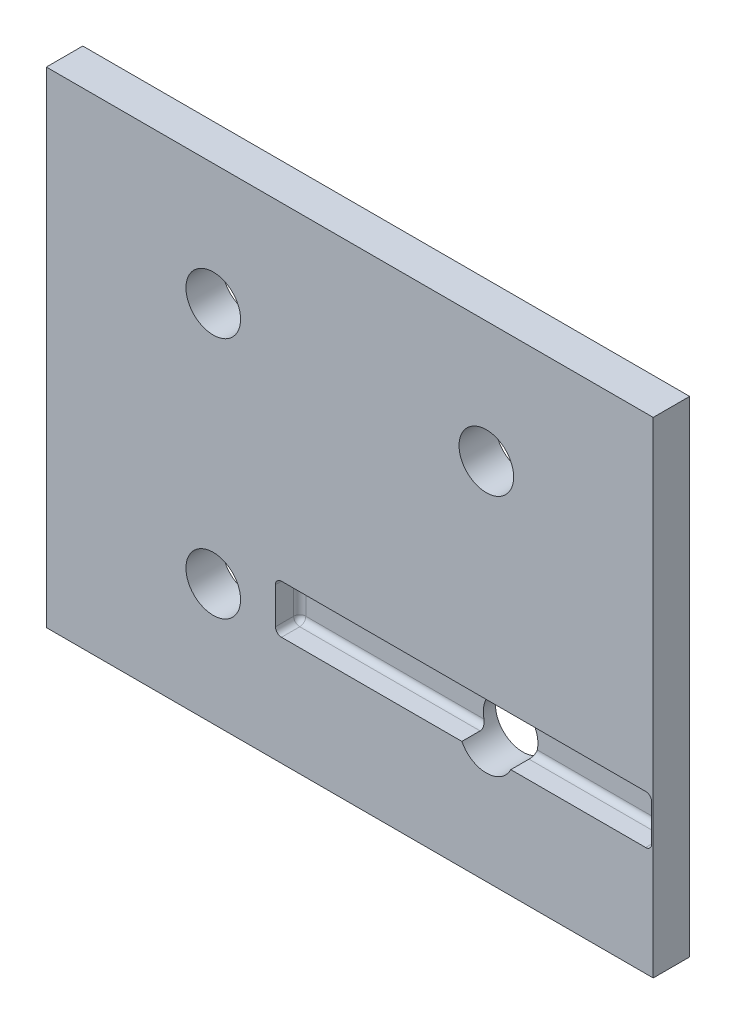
ISO-10303-21;
HEADER;
FILE_DESCRIPTION(('STEP AP214'),'2;1');
FILE_NAME('part.step','',(''),(''),'','','');
FILE_SCHEMA(('AUTOMOTIVE_DESIGN { 1 0 10303 214 1 1 1 1 }'));
ENDSEC;
DATA;
#1=APPLICATION_CONTEXT('core data for automotive mechanical design processes');
#2=APPLICATION_PROTOCOL_DEFINITION('international standard','automotive_design',2000,#1);
#3=PRODUCT_CONTEXT('',#1,'mechanical');
#4=PRODUCT('Part','Part','',(#3));
#5=PRODUCT_RELATED_PRODUCT_CATEGORY('part','',(#4));
#6=PRODUCT_DEFINITION_FORMATION('','',#4);
#7=PRODUCT_DEFINITION_CONTEXT('part definition',#1,'design');
#8=PRODUCT_DEFINITION('design','',#6,#7);
#9=PRODUCT_DEFINITION_SHAPE('','',#8);
#10=(LENGTH_UNIT() NAMED_UNIT(*) SI_UNIT(.MILLI.,.METRE.));
#11=(NAMED_UNIT(*) PLANE_ANGLE_UNIT() SI_UNIT($,.RADIAN.));
#12=(NAMED_UNIT(*) SI_UNIT($,.STERADIAN.) SOLID_ANGLE_UNIT());
#13=UNCERTAINTY_MEASURE_WITH_UNIT(LENGTH_MEASURE(1.E-05),#10,'distance_accuracy_value','');
#14=(GEOMETRIC_REPRESENTATION_CONTEXT(3) GLOBAL_UNCERTAINTY_ASSIGNED_CONTEXT((#13)) GLOBAL_UNIT_ASSIGNED_CONTEXT((#10,
#11,#12)) REPRESENTATION_CONTEXT('',''));
#15=CARTESIAN_POINT('',(0.,0.,0.));
#16=DIRECTION('',(0.,0.,1.));
#17=DIRECTION('',(1.,0.,0.));
#18=AXIS2_PLACEMENT_3D('',#15,#16,#17);
#19=CARTESIAN_POINT('',(-22.5,-42.,6.));
#20=DIRECTION('',(0.,0.707106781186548,-0.707106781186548));
#21=DIRECTION('',(0.577350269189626,0.577350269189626,0.577350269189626));
#22=AXIS2_PLACEMENT_3D('',#19,#20,#21);
#23=SPHERICAL_SURFACE('',#22,2.);
#24=CARTESIAN_POINT('',(-22.5,-42.,6.));
#25=DIRECTION('',(0.,0.,1.));
#26=DIRECTION('',(0.,1.,0.));
#27=AXIS2_PLACEMENT_3D('',#24,#25,#26);
#28=CIRCLE('',#27,2.);
#29=CARTESIAN_POINT('',(-24.5,-42.,6.));
#30=VERTEX_POINT('',#29);
#31=CARTESIAN_POINT('',(-22.5,-44.,6.));
#32=VERTEX_POINT('',#31);
#33=EDGE_CURVE('E446',#30,#32,#28,.T.);
#34=ORIENTED_EDGE('',*,*,#33,.T.);
#35=CARTESIAN_POINT('',(-22.5,-42.,6.));
#36=DIRECTION('',(-1.,0.,0.));
#37=DIRECTION('',(0.,1.,0.));
#38=AXIS2_PLACEMENT_3D('',#35,#36,#37);
#39=CIRCLE('',#38,2.);
#40=CARTESIAN_POINT('',(-22.5,-42.,4.));
#41=VERTEX_POINT('',#40);
#42=EDGE_CURVE('E445',#41,#32,#39,.T.);
#43=ORIENTED_EDGE('',*,*,#42,.F.);
#44=CARTESIAN_POINT('',(-22.5,-42.,6.));
#45=DIRECTION('',(0.,-1.,0.));
#46=DIRECTION('',(0.,0.,1.));
#47=AXIS2_PLACEMENT_3D('',#44,#45,#46);
#48=CIRCLE('',#47,2.);
#49=EDGE_CURVE('E10',#30,#41,#48,.T.);
#50=ORIENTED_EDGE('',*,*,#49,.F.);
#51=EDGE_LOOP('',(#34,#43,#50));
#52=FACE_BOUND('',#51,.T.);
#53=ADVANCED_FACE('F16',(#52),#23,.F.);
#54=CARTESIAN_POINT('',(-22.5,-42.,6.));
#55=DIRECTION('',(0.,1.,0.));
#56=DIRECTION('',(0.,0.,1.));
#57=AXIS2_PLACEMENT_3D('',#54,#55,#56);
#58=CYLINDRICAL_SURFACE('',#57,2.);
#59=DIRECTION('',(0.,1.,0.));
#60=VECTOR('',#59,1.);
#61=CARTESIAN_POINT('',(-24.5,-42.,6.));
#62=LINE('',#61,#60);
#63=CARTESIAN_POINT('',(-24.5,-30.,6.));
#64=VERTEX_POINT('',#63);
#65=EDGE_CURVE('E354',#30,#64,#62,.T.);
#66=ORIENTED_EDGE('',*,*,#65,.F.);
#67=ORIENTED_EDGE('',*,*,#49,.T.);
#68=DIRECTION('',(0.,1.,0.));
#69=VECTOR('',#68,1.);
#70=CARTESIAN_POINT('',(-22.5,-42.,4.));
#71=LINE('',#70,#69);
#72=CARTESIAN_POINT('',(-22.5,-30.,4.));
#73=VERTEX_POINT('',#72);
#74=EDGE_CURVE('E428',#41,#73,#71,.T.);
#75=ORIENTED_EDGE('',*,*,#74,.T.);
#76=CARTESIAN_POINT('',(-22.5,-30.,6.));
#77=DIRECTION('',(0.,-1.,0.));
#78=DIRECTION('',(0.,0.,1.));
#79=AXIS2_PLACEMENT_3D('',#76,#77,#78);
#80=CIRCLE('',#79,2.);
#81=EDGE_CURVE('E24',#64,#73,#80,.T.);
#82=ORIENTED_EDGE('',*,*,#81,.F.);
#83=EDGE_LOOP('',(#66,#67,#75,#82));
#84=FACE_BOUND('',#83,.T.);
#85=ADVANCED_FACE('F717',(#84),#58,.F.);
#86=CARTESIAN_POINT('',(-22.5,-30.,6.));
#87=DIRECTION('',(0.,0.707106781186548,0.707106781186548));
#88=DIRECTION('',(0.577350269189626,-0.577350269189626,0.577350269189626));
#89=AXIS2_PLACEMENT_3D('',#86,#87,#88);
#90=SPHERICAL_SURFACE('',#89,2.);
#91=CARTESIAN_POINT('',(-22.5,-30.,6.));
#92=DIRECTION('',(1.,0.,0.));
#93=DIRECTION('',(0.,-1.,0.));
#94=AXIS2_PLACEMENT_3D('',#91,#92,#93);
#95=CIRCLE('',#94,2.);
#96=CARTESIAN_POINT('',(-22.5,-28.,6.));
#97=VERTEX_POINT('',#96);
#98=EDGE_CURVE('E456',#73,#97,#95,.T.);
#99=ORIENTED_EDGE('',*,*,#98,.T.);
#100=CARTESIAN_POINT('',(-22.5,-30.,6.));
#101=DIRECTION('',(0.,0.,-1.));
#102=DIRECTION('',(0.,-1.,0.));
#103=AXIS2_PLACEMENT_3D('',#100,#101,#102);
#104=CIRCLE('',#103,2.);
#105=EDGE_CURVE('E288',#64,#97,#104,.T.);
#106=ORIENTED_EDGE('',*,*,#105,.F.);
#107=ORIENTED_EDGE('',*,*,#81,.T.);
#108=EDGE_LOOP('',(#99,#106,#107));
#109=FACE_BOUND('',#108,.T.);
#110=ADVANCED_FACE('F610',(#109),#90,.F.);
#111=CARTESIAN_POINT('',(97.5,-30.,6.));
#112=DIRECTION('',(-1.,0.,0.));
#113=DIRECTION('',(0.,-1.,0.));
#114=AXIS2_PLACEMENT_3D('',#111,#112,#113);
#115=CYLINDRICAL_SURFACE('',#114,2.);
#116=DIRECTION('',(-1.,0.,0.));
#117=VECTOR('',#116,1.);
#118=CARTESIAN_POINT('',(97.5,-30.,4.));
#119=LINE('',#118,#117);
#120=CARTESIAN_POINT('',(97.5,-30.,4.));
#121=VERTEX_POINT('',#120);
#122=EDGE_CURVE('E432',#121,#73,#119,.T.);
#123=ORIENTED_EDGE('',*,*,#122,.F.);
#124=CARTESIAN_POINT('',(97.5,-30.,6.));
#125=DIRECTION('',(1.,0.,0.));
#126=DIRECTION('',(0.,-1.,0.));
#127=AXIS2_PLACEMENT_3D('',#124,#125,#126);
#128=CIRCLE('',#127,2.);
#129=CARTESIAN_POINT('',(97.5,-28.,6.));
#130=VERTEX_POINT('',#129);
#131=EDGE_CURVE('E453',#121,#130,#128,.T.);
#132=ORIENTED_EDGE('',*,*,#131,.T.);
#133=DIRECTION('',(-1.,0.,0.));
#134=VECTOR('',#133,1.);
#135=CARTESIAN_POINT('',(97.5,-28.,6.));
#136=LINE('',#135,#134);
#137=EDGE_CURVE('E289',#130,#97,#136,.T.);
#138=ORIENTED_EDGE('',*,*,#137,.T.);
#139=ORIENTED_EDGE('',*,*,#98,.F.);
#140=EDGE_LOOP('',(#123,#132,#138,#139));
#141=FACE_BOUND('',#140,.T.);
#142=ADVANCED_FACE('F488',(#141),#115,.F.);
#143=CARTESIAN_POINT('',(97.5,-30.,6.));
#144=DIRECTION('',(0.,-0.707106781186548,-0.707106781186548));
#145=DIRECTION('',(-0.577350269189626,-0.577350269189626,0.577350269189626));
#146=AXIS2_PLACEMENT_3D('',#143,#144,#145);
#147=SPHERICAL_SURFACE('',#146,2.);
#148=CARTESIAN_POINT('',(97.5,-30.,6.));
#149=DIRECTION('',(0.,0.,1.));
#150=DIRECTION('',(0.,-1.,0.));
#151=AXIS2_PLACEMENT_3D('',#148,#149,#150);
#152=CIRCLE('',#151,2.);
#153=CARTESIAN_POINT('',(99.5,-30.,6.));
#154=VERTEX_POINT('',#153);
#155=EDGE_CURVE('E274',#154,#130,#152,.T.);
#156=ORIENTED_EDGE('',*,*,#155,.T.);
#157=ORIENTED_EDGE('',*,*,#131,.F.);
#158=CARTESIAN_POINT('',(97.5,-30.,6.));
#159=DIRECTION('',(0.,1.,0.));
#160=DIRECTION('',(0.,0.,1.));
#161=AXIS2_PLACEMENT_3D('',#158,#159,#160);
#162=CIRCLE('',#161,2.);
#163=EDGE_CURVE('E444',#154,#121,#162,.T.);
#164=ORIENTED_EDGE('',*,*,#163,.F.);
#165=EDGE_LOOP('',(#156,#157,#164));
#166=FACE_BOUND('',#165,.T.);
#167=ADVANCED_FACE('F482',(#166),#147,.F.);
#168=CARTESIAN_POINT('',(97.5,-42.,6.));
#169=DIRECTION('',(0.,1.,0.));
#170=DIRECTION('',(0.,0.,1.));
#171=AXIS2_PLACEMENT_3D('',#168,#169,#170);
#172=CYLINDRICAL_SURFACE('',#171,2.);
#173=ORIENTED_EDGE('',*,*,#163,.T.);
#174=DIRECTION('',(0.,1.,0.));
#175=VECTOR('',#174,1.);
#176=CARTESIAN_POINT('',(97.5,-42.,4.));
#177=LINE('',#176,#175);
#178=CARTESIAN_POINT('',(97.5,-42.,4.));
#179=VERTEX_POINT('',#178);
#180=EDGE_CURVE('E338',#179,#121,#177,.T.);
#181=ORIENTED_EDGE('',*,*,#180,.F.);
#182=CARTESIAN_POINT('',(97.5,-42.,6.));
#183=DIRECTION('',(0.,1.,0.));
#184=DIRECTION('',(0.,0.,1.));
#185=AXIS2_PLACEMENT_3D('',#182,#183,#184);
#186=CIRCLE('',#185,2.);
#187=CARTESIAN_POINT('',(99.5,-42.,6.));
#188=VERTEX_POINT('',#187);
#189=EDGE_CURVE('E441',#188,#179,#186,.T.);
#190=ORIENTED_EDGE('',*,*,#189,.F.);
#191=DIRECTION('',(0.,1.,0.));
#192=VECTOR('',#191,1.);
#193=CARTESIAN_POINT('',(99.5,-42.,6.));
#194=LINE('',#193,#192);
#195=EDGE_CURVE('E419',#188,#154,#194,.T.);
#196=ORIENTED_EDGE('',*,*,#195,.T.);
#197=EDGE_LOOP('',(#173,#181,#190,#196));
#198=FACE_BOUND('',#197,.T.);
#199=ADVANCED_FACE('F487',(#198),#172,.F.);
#200=CARTESIAN_POINT('',(97.5,-42.,6.));
#201=DIRECTION('',(0.,-0.707106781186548,0.707106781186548));
#202=DIRECTION('',(-0.577350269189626,0.577350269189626,0.577350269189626));
#203=AXIS2_PLACEMENT_3D('',#200,#201,#202);
#204=SPHERICAL_SURFACE('',#203,2.);
#205=CARTESIAN_POINT('',(97.5,-42.,6.));
#206=DIRECTION('',(-1.,0.,0.));
#207=DIRECTION('',(0.,1.,0.));
#208=AXIS2_PLACEMENT_3D('',#205,#206,#207);
#209=CIRCLE('',#208,2.);
#210=CARTESIAN_POINT('',(97.5,-44.,6.));
#211=VERTEX_POINT('',#210);
#212=EDGE_CURVE('E466',#179,#211,#209,.T.);
#213=ORIENTED_EDGE('',*,*,#212,.T.);
#214=CARTESIAN_POINT('',(97.5,-42.,6.));
#215=DIRECTION('',(0.,0.,-1.));
#216=DIRECTION('',(0.,1.,0.));
#217=AXIS2_PLACEMENT_3D('',#214,#215,#216);
#218=CIRCLE('',#217,2.);
#219=EDGE_CURVE('E253',#188,#211,#218,.T.);
#220=ORIENTED_EDGE('',*,*,#219,.F.);
#221=ORIENTED_EDGE('',*,*,#189,.T.);
#222=EDGE_LOOP('',(#213,#220,#221));
#223=FACE_BOUND('',#222,.T.);
#224=ADVANCED_FACE('F694',(#223),#204,.F.);
#225=CARTESIAN_POINT('',(97.5,-42.,6.));
#226=DIRECTION('',(-1.,0.,0.));
#227=DIRECTION('',(0.,1.,0.));
#228=AXIS2_PLACEMENT_3D('',#225,#226,#227);
#229=CYLINDRICAL_SURFACE('',#228,2.);
#230=ORIENTED_EDGE('',*,*,#42,.T.);
#231=DIRECTION('',(-1.,0.,0.));
#232=VECTOR('',#231,1.);
#233=CARTESIAN_POINT('',(97.5,-44.,6.));
#234=LINE('',#233,#232);
#235=CARTESIAN_POINT('',(36.937742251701,-44.,6.));
#236=VERTEX_POINT('',#235);
#237=EDGE_CURVE('E339',#236,#32,#234,.T.);
#238=ORIENTED_EDGE('',*,*,#237,.F.);
#239=CARTESIAN_POINT('',(36.225035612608,-42.,4.));
#240=CARTESIAN_POINT('',(36.280961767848,-42.24537501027,4.));
#241=CARTESIAN_POINT('',(36.34357534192,-42.48314370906,4.035121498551));
#242=CARTESIAN_POINT('',(36.410977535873,-42.70811551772,4.101447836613));
#243=CARTESIAN_POINT('',(36.480506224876,-42.91622868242,4.19465857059));
#244=CARTESIAN_POINT('',(36.549100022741,-43.10441301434,4.309987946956));
#245=CARTESIAN_POINT('',(36.613887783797,-43.27065664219,4.442229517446));
#246=CARTESIAN_POINT('',(36.741289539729,-43.58138901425,4.752961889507));
#247=CARTESIAN_POINT('',(36.803076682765,-43.7209321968,4.938615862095));
#248=CARTESIAN_POINT('',(36.855403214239,-43.83249840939,5.137862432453));
#249=CARTESIAN_POINT('',(36.896136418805,-43.91614081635,5.346790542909));
#250=CARTESIAN_POINT('',(36.923835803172,-43.97197063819,5.562091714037));
#251=CARTESIAN_POINT('',(36.937742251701,-44.,5.780795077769));
#252=CARTESIAN_POINT('',(36.937742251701,-44.,6.));
#253=(BOUNDED_CURVE() B_SPLINE_CURVE(7,(#239,#240,#241,#242,#243,#244,#245,#246,#247,#248,#249,
#250,#251,#252),.UNSPECIFIED.,.F.,.F.) B_SPLINE_CURVE_WITH_KNOTS((8,6,8),(0.,0.46199537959,1.),
.UNSPECIFIED.) CURVE() GEOMETRIC_REPRESENTATION_ITEM() RATIONAL_B_SPLINE_CURVE((1.,1.,1.,1.,1.,
1.,1.,1.,1.,1.,1.,1.,1.,1.)) REPRESENTATION_ITEM(''));
#254=CARTESIAN_POINT('',(36.225035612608,-42.,4.));
#255=VERTEX_POINT('',#254);
#256=EDGE_CURVE('E306',#255,#236,#253,.T.);
#257=ORIENTED_EDGE('',*,*,#256,.F.);
#258=DIRECTION('',(-1.,0.,0.));
#259=VECTOR('',#258,1.);
#260=CARTESIAN_POINT('',(97.5,-42.,4.));
#261=LINE('',#260,#259);
#262=EDGE_CURVE('E431',#255,#41,#261,.T.);
#263=ORIENTED_EDGE('',*,*,#262,.T.);
#264=EDGE_LOOP('',(#230,#238,#257,#263));
#265=FACE_BOUND('',#264,.T.);
#266=ADVANCED_FACE('F685',(#265),#229,.F.);
#267=CARTESIAN_POINT('',(97.5,-42.,6.));
#268=DIRECTION('',(-1.,0.,0.));
#269=DIRECTION('',(0.,1.,0.));
#270=AXIS2_PLACEMENT_3D('',#267,#268,#269);
#271=CYLINDRICAL_SURFACE('',#270,2.);
#272=CARTESIAN_POINT('',(53.774964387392,-42.,4.));
#273=CARTESIAN_POINT('',(53.719038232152,-42.24537501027,4.));
#274=CARTESIAN_POINT('',(53.65642465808,-42.48314370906,4.035121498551));
#275=CARTESIAN_POINT('',(53.589022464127,-42.70811551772,4.101447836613));
#276=CARTESIAN_POINT('',(53.519493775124,-42.91622868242,4.19465857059));
#277=CARTESIAN_POINT('',(53.450899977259,-43.10441301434,4.309987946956));
#278=CARTESIAN_POINT('',(53.386112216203,-43.27065664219,4.442229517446));
#279=CARTESIAN_POINT('',(53.258710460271,-43.58138901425,4.752961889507));
#280=CARTESIAN_POINT('',(53.196923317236,-43.7209321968,4.938615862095));
#281=CARTESIAN_POINT('',(53.144596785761,-43.83249840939,5.137862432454));
#282=CARTESIAN_POINT('',(53.103863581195,-43.91614081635,5.346790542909));
#283=CARTESIAN_POINT('',(53.076164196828,-43.97197063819,5.562091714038));
#284=CARTESIAN_POINT('',(53.062257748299,-44.,5.780795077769));
#285=CARTESIAN_POINT('',(53.062257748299,-44.,6.));
#286=(BOUNDED_CURVE() B_SPLINE_CURVE(7,(#272,#273,#274,#275,#276,#277,#278,#279,#280,#281,#282,
#283,#284,#285),.UNSPECIFIED.,.F.,.F.) B_SPLINE_CURVE_WITH_KNOTS((8,6,8),(0.,0.46199537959,1.),
.UNSPECIFIED.) CURVE() GEOMETRIC_REPRESENTATION_ITEM() RATIONAL_B_SPLINE_CURVE((1.,1.,1.,1.,1.,
1.,1.,1.,1.,1.,1.,1.,1.,1.)) REPRESENTATION_ITEM(''));
#287=CARTESIAN_POINT('',(53.774964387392,-42.,4.));
#288=VERTEX_POINT('',#287);
#289=CARTESIAN_POINT('',(53.062257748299,-44.,6.));
#290=VERTEX_POINT('',#289);
#291=EDGE_CURVE('E370',#288,#290,#286,.T.);
#292=ORIENTED_EDGE('',*,*,#291,.T.);
#293=DIRECTION('',(-1.,0.,0.));
#294=VECTOR('',#293,1.);
#295=CARTESIAN_POINT('',(97.5,-44.,6.));
#296=LINE('',#295,#294);
#297=EDGE_CURVE('E262',#211,#290,#296,.T.);
#298=ORIENTED_EDGE('',*,*,#297,.F.);
#299=ORIENTED_EDGE('',*,*,#212,.F.);
#300=DIRECTION('',(-1.,0.,0.));
#301=VECTOR('',#300,1.);
#302=CARTESIAN_POINT('',(97.5,-42.,4.));
#303=LINE('',#302,#301);
#304=EDGE_CURVE('E335',#179,#288,#303,.T.);
#305=ORIENTED_EDGE('',*,*,#304,.T.);
#306=EDGE_LOOP('',(#292,#298,#299,#305));
#307=FACE_BOUND('',#306,.T.);
#308=ADVANCED_FACE('F676',(#307),#271,.F.);
#309=CARTESIAN_POINT('',(97.5,-42.,4.));
#310=DIRECTION('',(0.,0.,1.));
#311=DIRECTION('',(1.,0.,0.));
#312=AXIS2_PLACEMENT_3D('',#309,#310,#311);
#313=PLANE('',#312);
#314=ORIENTED_EDGE('',*,*,#304,.F.);
#315=ORIENTED_EDGE('',*,*,#180,.T.);
#316=ORIENTED_EDGE('',*,*,#122,.T.);
#317=ORIENTED_EDGE('',*,*,#74,.F.);
#318=ORIENTED_EDGE('',*,*,#262,.F.);
#319=CARTESIAN_POINT('',(45.,-40.,4.));
#320=DIRECTION('',(0.,0.,-1.));
#321=DIRECTION('',(1.,0.,0.));
#322=AXIS2_PLACEMENT_3D('',#319,#320,#321);
#323=CIRCLE('',#322,9.);
#324=CARTESIAN_POINT('',(54.,-40.,4.));
#325=VERTEX_POINT('',#324);
#326=EDGE_CURVE('E313',#255,#325,#323,.T.);
#327=ORIENTED_EDGE('',*,*,#326,.T.);
#328=CARTESIAN_POINT('',(45.,-40.,4.));
#329=DIRECTION('',(0.,0.,-1.));
#330=DIRECTION('',(1.,0.,0.));
#331=AXIS2_PLACEMENT_3D('',#328,#329,#330);
#332=CIRCLE('',#331,9.);
#333=EDGE_CURVE('E376',#325,#288,#332,.T.);
#334=ORIENTED_EDGE('',*,*,#333,.T.);
#335=EDGE_LOOP('',(#314,#315,#316,#317,#318,#327,#334));
#336=FACE_BOUND('',#335,.T.);
#337=ADVANCED_FACE('F667',(#336),#313,.T.);
#338=CARTESIAN_POINT('',(37.5,-44.,66.));
#339=DIRECTION('',(0.,1.,0.));
#340=DIRECTION('',(1.,0.,0.));
#341=AXIS2_PLACEMENT_3D('',#338,#339,#340);
#342=PLANE('',#341);
#343=ORIENTED_EDGE('',*,*,#237,.T.);
#344=DIRECTION('',(0.,0.,1.));
#345=VECTOR('',#344,1.);
#346=CARTESIAN_POINT('',(-22.5,-44.,6.));
#347=LINE('',#346,#345);
#348=CARTESIAN_POINT('',(-22.5,-44.,12.));
#349=VERTEX_POINT('',#348);
#350=EDGE_CURVE('E240',#32,#349,#347,.T.);
#351=ORIENTED_EDGE('',*,*,#350,.T.);
#352=DIRECTION('',(-1.,0.,0.));
#353=VECTOR('',#352,1.);
#354=CARTESIAN_POINT('',(18.75,-44.,12.));
#355=LINE('',#354,#353);
#356=CARTESIAN_POINT('',(36.937742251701,-44.,12.));
#357=VERTEX_POINT('',#356);
#358=EDGE_CURVE('E343',#357,#349,#355,.T.);
#359=ORIENTED_EDGE('',*,*,#358,.F.);
#360=DIRECTION('',(0.,0.,-1.));
#361=VECTOR('',#360,1.);
#362=CARTESIAN_POINT('',(36.937742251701,-44.,0.));
#363=LINE('',#362,#361);
#364=EDGE_CURVE('E312',#357,#236,#363,.T.);
#365=ORIENTED_EDGE('',*,*,#364,.T.);
#366=EDGE_LOOP('',(#343,#351,#359,#365));
#367=FACE_BOUND('',#366,.T.);
#368=ADVANCED_FACE('F658',(#367),#342,.T.);
#369=CARTESIAN_POINT('',(-22.5,-42.,6.));
#370=DIRECTION('',(0.,0.,1.));
#371=DIRECTION('',(0.,1.,0.));
#372=AXIS2_PLACEMENT_3D('',#369,#370,#371);
#373=CYLINDRICAL_SURFACE('',#372,2.);
#374=CARTESIAN_POINT('',(-22.5,-42.,12.));
#375=DIRECTION('',(0.,0.,1.));
#376=DIRECTION('',(0.,1.,0.));
#377=AXIS2_PLACEMENT_3D('',#374,#375,#376);
#378=CIRCLE('',#377,2.);
#379=CARTESIAN_POINT('',(-24.5,-42.,12.));
#380=VERTEX_POINT('',#379);
#381=EDGE_CURVE('E347',#380,#349,#378,.T.);
#382=ORIENTED_EDGE('',*,*,#381,.T.);
#383=ORIENTED_EDGE('',*,*,#350,.F.);
#384=ORIENTED_EDGE('',*,*,#33,.F.);
#385=DIRECTION('',(0.,0.,1.));
#386=VECTOR('',#385,1.);
#387=CARTESIAN_POINT('',(-24.5,-42.,6.));
#388=LINE('',#387,#386);
#389=EDGE_CURVE('E358',#30,#380,#388,.T.);
#390=ORIENTED_EDGE('',*,*,#389,.T.);
#391=EDGE_LOOP('',(#382,#383,#384,#390));
#392=FACE_BOUND('',#391,.T.);
#393=ADVANCED_FACE('F649',(#392),#373,.F.);
#394=CARTESIAN_POINT('',(-24.5,-42.,6.));
#395=DIRECTION('',(1.,0.,0.));
#396=DIRECTION('',(0.,1.,0.));
#397=AXIS2_PLACEMENT_3D('',#394,#395,#396);
#398=PLANE('',#397);
#399=ORIENTED_EDGE('',*,*,#389,.F.);
#400=ORIENTED_EDGE('',*,*,#65,.T.);
#401=DIRECTION('',(0.,0.,1.));
#402=VECTOR('',#401,1.);
#403=CARTESIAN_POINT('',(-24.5,-30.,6.));
#404=LINE('',#403,#402);
#405=CARTESIAN_POINT('',(-24.5,-30.,12.));
#406=VERTEX_POINT('',#405);
#407=EDGE_CURVE('E285',#64,#406,#404,.T.);
#408=ORIENTED_EDGE('',*,*,#407,.T.);
#409=DIRECTION('',(0.,1.,0.));
#410=VECTOR('',#409,1.);
#411=CARTESIAN_POINT('',(-24.5,-21.,12.));
#412=LINE('',#411,#410);
#413=EDGE_CURVE('E330',#380,#406,#412,.T.);
#414=ORIENTED_EDGE('',*,*,#413,.F.);
#415=EDGE_LOOP('',(#399,#400,#408,#414));
#416=FACE_BOUND('',#415,.T.);
#417=ADVANCED_FACE('F594',(#416),#398,.T.);
#418=CARTESIAN_POINT('',(-22.5,-30.,6.));
#419=DIRECTION('',(0.,0.,1.));
#420=DIRECTION('',(0.,-1.,0.));
#421=AXIS2_PLACEMENT_3D('',#418,#419,#420);
#422=CYLINDRICAL_SURFACE('',#421,2.);
#423=ORIENTED_EDGE('',*,*,#407,.F.);
#424=ORIENTED_EDGE('',*,*,#105,.T.);
#425=DIRECTION('',(0.,0.,1.));
#426=VECTOR('',#425,1.);
#427=CARTESIAN_POINT('',(-22.5,-28.,6.));
#428=LINE('',#427,#426);
#429=CARTESIAN_POINT('',(-22.5,-28.,12.));
#430=VERTEX_POINT('',#429);
#431=EDGE_CURVE('E278',#97,#430,#428,.T.);
#432=ORIENTED_EDGE('',*,*,#431,.T.);
#433=CARTESIAN_POINT('',(-22.5,-30.,12.));
#434=DIRECTION('',(0.,0.,1.));
#435=DIRECTION('',(0.,-1.,0.));
#436=AXIS2_PLACEMENT_3D('',#433,#434,#435);
#437=CIRCLE('',#436,2.);
#438=EDGE_CURVE('E326',#430,#406,#437,.T.);
#439=ORIENTED_EDGE('',*,*,#438,.T.);
#440=EDGE_LOOP('',(#423,#424,#432,#439));
#441=FACE_BOUND('',#440,.T.);
#442=ADVANCED_FACE('F544',(#441),#422,.F.);
#443=CARTESIAN_POINT('',(37.5,-28.,66.));
#444=DIRECTION('',(0.,1.,0.));
#445=DIRECTION('',(1.,0.,0.));
#446=AXIS2_PLACEMENT_3D('',#443,#444,#445);
#447=PLANE('',#446);
#448=DIRECTION('',(0.,0.,-1.));
#449=VECTOR('',#448,1.);
#450=CARTESIAN_POINT('',(97.5,-28.,126.));
#451=LINE('',#450,#449);
#452=CARTESIAN_POINT('',(97.5,-28.,12.));
#453=VERTEX_POINT('',#452);
#454=EDGE_CURVE('E279',#453,#130,#451,.T.);
#455=ORIENTED_EDGE('',*,*,#454,.F.);
#456=DIRECTION('',(-1.,0.,0.));
#457=VECTOR('',#456,1.);
#458=CARTESIAN_POINT('',(18.75,-28.,12.));
#459=LINE('',#458,#457);
#460=EDGE_CURVE('E325',#453,#430,#459,.T.);
#461=ORIENTED_EDGE('',*,*,#460,.T.);
#462=ORIENTED_EDGE('',*,*,#431,.F.);
#463=ORIENTED_EDGE('',*,*,#137,.F.);
#464=EDGE_LOOP('',(#455,#461,#462,#463));
#465=FACE_BOUND('',#464,.T.);
#466=ADVANCED_FACE('F538',(#465),#447,.F.);
#467=CARTESIAN_POINT('',(97.5,-30.,126.));
#468=DIRECTION('',(0.,0.,-1.));
#469=DIRECTION('',(0.,-1.,0.));
#470=AXIS2_PLACEMENT_3D('',#467,#468,#469);
#471=CYLINDRICAL_SURFACE('',#470,2.);
#472=DIRECTION('',(0.,0.,-1.));
#473=VECTOR('',#472,1.);
#474=CARTESIAN_POINT('',(99.5,-30.,126.));
#475=LINE('',#474,#473);
#476=CARTESIAN_POINT('',(99.5,-30.,12.));
#477=VERTEX_POINT('',#476);
#478=EDGE_CURVE('E252',#477,#154,#475,.T.);
#479=ORIENTED_EDGE('',*,*,#478,.F.);
#480=CARTESIAN_POINT('',(97.5,-30.,12.));
#481=DIRECTION('',(0.,0.,-1.));
#482=DIRECTION('',(0.,-1.,0.));
#483=AXIS2_PLACEMENT_3D('',#480,#481,#482);
#484=CIRCLE('',#483,2.);
#485=EDGE_CURVE('E320',#453,#477,#484,.T.);
#486=ORIENTED_EDGE('',*,*,#485,.F.);
#487=ORIENTED_EDGE('',*,*,#454,.T.);
#488=ORIENTED_EDGE('',*,*,#155,.F.);
#489=EDGE_LOOP('',(#479,#486,#487,#488));
#490=FACE_BOUND('',#489,.T.);
#491=ADVANCED_FACE('F543',(#490),#471,.F.);
#492=CARTESIAN_POINT('',(99.5,-42.,126.));
#493=DIRECTION('',(-1.,0.,0.));
#494=DIRECTION('',(0.,0.,1.));
#495=AXIS2_PLACEMENT_3D('',#492,#493,#494);
#496=PLANE('',#495);
#497=DIRECTION('',(0.,0.,-1.));
#498=VECTOR('',#497,1.);
#499=CARTESIAN_POINT('',(99.5,-42.,126.));
#500=LINE('',#499,#498);
#501=CARTESIAN_POINT('',(99.5,-42.,12.));
#502=VERTEX_POINT('',#501);
#503=EDGE_CURVE('E248',#502,#188,#500,.T.);
#504=ORIENTED_EDGE('',*,*,#503,.F.);
#505=DIRECTION('',(0.,-1.,0.));
#506=VECTOR('',#505,1.);
#507=CARTESIAN_POINT('',(99.5,-21.,12.));
#508=LINE('',#507,#506);
#509=EDGE_CURVE('E324',#477,#502,#508,.T.);
#510=ORIENTED_EDGE('',*,*,#509,.F.);
#511=ORIENTED_EDGE('',*,*,#478,.T.);
#512=ORIENTED_EDGE('',*,*,#195,.F.);
#513=EDGE_LOOP('',(#504,#510,#511,#512));
#514=FACE_BOUND('',#513,.T.);
#515=ADVANCED_FACE('F578',(#514),#496,.T.);
#516=CARTESIAN_POINT('',(97.5,-42.,126.));
#517=DIRECTION('',(0.,0.,-1.));
#518=DIRECTION('',(0.,1.,0.));
#519=AXIS2_PLACEMENT_3D('',#516,#517,#518);
#520=CYLINDRICAL_SURFACE('',#519,2.);
#521=ORIENTED_EDGE('',*,*,#219,.T.);
#522=DIRECTION('',(0.,0.,-1.));
#523=VECTOR('',#522,1.);
#524=CARTESIAN_POINT('',(97.5,-44.,126.));
#525=LINE('',#524,#523);
#526=CARTESIAN_POINT('',(97.5,-44.,12.));
#527=VERTEX_POINT('',#526);
#528=EDGE_CURVE('E264',#527,#211,#525,.T.);
#529=ORIENTED_EDGE('',*,*,#528,.F.);
#530=CARTESIAN_POINT('',(97.5,-42.,12.));
#531=DIRECTION('',(0.,0.,-1.));
#532=DIRECTION('',(0.,1.,0.));
#533=AXIS2_PLACEMENT_3D('',#530,#531,#532);
#534=CIRCLE('',#533,2.);
#535=EDGE_CURVE('E365',#502,#527,#534,.T.);
#536=ORIENTED_EDGE('',*,*,#535,.F.);
#537=ORIENTED_EDGE('',*,*,#503,.T.);
#538=EDGE_LOOP('',(#521,#529,#536,#537));
#539=FACE_BOUND('',#538,.T.);
#540=ADVANCED_FACE('F619',(#539),#520,.F.);
#541=CARTESIAN_POINT('',(37.5,-44.,66.));
#542=DIRECTION('',(0.,1.,0.));
#543=DIRECTION('',(1.,0.,0.));
#544=AXIS2_PLACEMENT_3D('',#541,#542,#543);
#545=PLANE('',#544);
#546=ORIENTED_EDGE('',*,*,#297,.T.);
#547=DIRECTION('',(0.,0.,-1.));
#548=VECTOR('',#547,1.);
#549=CARTESIAN_POINT('',(53.062257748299,-44.,0.));
#550=LINE('',#549,#548);
#551=CARTESIAN_POINT('',(53.062257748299,-44.,12.));
#552=VERTEX_POINT('',#551);
#553=EDGE_CURVE('E377',#552,#290,#550,.T.);
#554=ORIENTED_EDGE('',*,*,#553,.F.);
#555=DIRECTION('',(-1.,0.,0.));
#556=VECTOR('',#555,1.);
#557=CARTESIAN_POINT('',(18.75,-44.,12.));
#558=LINE('',#557,#556);
#559=EDGE_CURVE('E369',#527,#552,#558,.T.);
#560=ORIENTED_EDGE('',*,*,#559,.F.);
#561=ORIENTED_EDGE('',*,*,#528,.T.);
#562=EDGE_LOOP('',(#546,#554,#560,#561));
#563=FACE_BOUND('',#562,.T.);
#564=ADVANCED_FACE('F531',(#563),#545,.T.);
#565=CARTESIAN_POINT('',(45.,40.,0.));
#566=DIRECTION('',(0.,0.,-1.));
#567=DIRECTION('',(1.,0.,0.));
#568=AXIS2_PLACEMENT_3D('',#565,#566,#567);
#569=CYLINDRICAL_SURFACE('',#568,9.);
#570=DIRECTION('',(0.,0.,1.));
#571=VECTOR('',#570,1.);
#572=CARTESIAN_POINT('',(54.,40.,0.));
#573=LINE('',#572,#571);
#574=CARTESIAN_POINT('',(54.,40.,0.));
#575=VERTEX_POINT('',#574);
#576=CARTESIAN_POINT('',(54.,40.,12.));
#577=VERTEX_POINT('',#576);
#578=EDGE_CURVE('E265',#575,#577,#573,.T.);
#579=ORIENTED_EDGE('',*,*,#578,.T.);
#580=CARTESIAN_POINT('',(45.,40.,12.));
#581=DIRECTION('',(0.,0.,1.));
#582=DIRECTION('',(1.,0.,0.));
#583=AXIS2_PLACEMENT_3D('',#580,#581,#582);
#584=CIRCLE('',#583,9.);
#585=EDGE_CURVE('E242',#577,#577,#584,.T.);
#586=ORIENTED_EDGE('',*,*,#585,.T.);
#587=ORIENTED_EDGE('',*,*,#578,.F.);
#588=CARTESIAN_POINT('',(45.,40.,0.));
#589=DIRECTION('',(0.,0.,1.));
#590=DIRECTION('',(1.,0.,0.));
#591=AXIS2_PLACEMENT_3D('',#588,#589,#590);
#592=CIRCLE('',#591,9.);
#593=EDGE_CURVE('E301',#575,#575,#592,.T.);
#594=ORIENTED_EDGE('',*,*,#593,.F.);
#595=EDGE_LOOP('',(#579,#586,#587,#594));
#596=FACE_BOUND('',#595,.T.);
#597=ADVANCED_FACE('F525',(#596),#569,.F.);
#598=CARTESIAN_POINT('',(45.,-40.,0.));
#599=DIRECTION('',(0.,0.,-1.));
#600=DIRECTION('',(1.,0.,0.));
#601=AXIS2_PLACEMENT_3D('',#598,#599,#600);
#602=CYLINDRICAL_SURFACE('',#601,9.);
#603=CARTESIAN_POINT('',(45.,-40.,0.));
#604=DIRECTION('',(0.,0.,1.));
#605=DIRECTION('',(1.,0.,0.));
#606=AXIS2_PLACEMENT_3D('',#603,#604,#605);
#607=CIRCLE('',#606,9.);
#608=CARTESIAN_POINT('',(54.,-40.,0.));
#609=VERTEX_POINT('',#608);
#610=EDGE_CURVE('E297',#609,#609,#607,.T.);
#611=ORIENTED_EDGE('',*,*,#610,.F.);
#612=DIRECTION('',(0.,0.,1.));
#613=VECTOR('',#612,1.);
#614=CARTESIAN_POINT('',(54.,-40.,0.));
#615=LINE('',#614,#613);
#616=EDGE_CURVE('E392',#609,#325,#615,.T.);
#617=ORIENTED_EDGE('',*,*,#616,.T.);
#618=ORIENTED_EDGE('',*,*,#326,.F.);
#619=ORIENTED_EDGE('',*,*,#256,.T.);
#620=ORIENTED_EDGE('',*,*,#364,.F.);
#621=CARTESIAN_POINT('',(45.,-40.,12.));
#622=DIRECTION('',(0.,0.,1.));
#623=DIRECTION('',(1.,0.,0.));
#624=AXIS2_PLACEMENT_3D('',#621,#622,#623);
#625=CIRCLE('',#624,9.);
#626=EDGE_CURVE('E334',#357,#552,#625,.T.);
#627=ORIENTED_EDGE('',*,*,#626,.T.);
#628=ORIENTED_EDGE('',*,*,#553,.T.);
#629=ORIENTED_EDGE('',*,*,#291,.F.);
#630=ORIENTED_EDGE('',*,*,#333,.F.);
#631=ORIENTED_EDGE('',*,*,#616,.F.);
#632=EDGE_LOOP('',(#611,#617,#618,#619,#620,#627,#628,#629,#630,#631));
#633=FACE_BOUND('',#632,.T.);
#634=ADVANCED_FACE('F530',(#633),#602,.F.);
#635=CARTESIAN_POINT('',(-45.,40.,0.));
#636=DIRECTION('',(0.,0.,-1.));
#637=DIRECTION('',(1.,0.,0.));
#638=AXIS2_PLACEMENT_3D('',#635,#636,#637);
#639=CYLINDRICAL_SURFACE('',#638,9.);
#640=DIRECTION('',(0.,0.,1.));
#641=VECTOR('',#640,1.);
#642=CARTESIAN_POINT('',(-36.,40.,0.));
#643=LINE('',#642,#641);
#644=CARTESIAN_POINT('',(-36.,40.,0.));
#645=VERTEX_POINT('',#644);
#646=CARTESIAN_POINT('',(-36.,40.,12.));
#647=VERTEX_POINT('',#646);
#648=EDGE_CURVE('E389',#645,#647,#643,.T.);
#649=ORIENTED_EDGE('',*,*,#648,.T.);
#650=CARTESIAN_POINT('',(-45.,40.,12.));
#651=DIRECTION('',(0.,0.,1.));
#652=DIRECTION('',(1.,0.,0.));
#653=AXIS2_PLACEMENT_3D('',#650,#651,#652);
#654=CIRCLE('',#653,9.);
#655=EDGE_CURVE('E246',#647,#647,#654,.T.);
#656=ORIENTED_EDGE('',*,*,#655,.T.);
#657=ORIENTED_EDGE('',*,*,#648,.F.);
#658=CARTESIAN_POINT('',(-45.,40.,0.));
#659=DIRECTION('',(0.,0.,1.));
#660=DIRECTION('',(1.,0.,0.));
#661=AXIS2_PLACEMENT_3D('',#658,#659,#660);
#662=CIRCLE('',#661,9.);
#663=EDGE_CURVE('E260',#645,#645,#662,.T.);
#664=ORIENTED_EDGE('',*,*,#663,.F.);
#665=EDGE_LOOP('',(#649,#656,#657,#664));
#666=FACE_BOUND('',#665,.T.);
#667=ADVANCED_FACE('F502',(#666),#639,.F.);
#668=CARTESIAN_POINT('',(-45.,-40.,0.));
#669=DIRECTION('',(0.,0.,-1.));
#670=DIRECTION('',(1.,0.,0.));
#671=AXIS2_PLACEMENT_3D('',#668,#669,#670);
#672=CYLINDRICAL_SURFACE('',#671,9.);
#673=DIRECTION('',(0.,0.,1.));
#674=VECTOR('',#673,1.);
#675=CARTESIAN_POINT('',(-36.,-40.,0.));
#676=LINE('',#675,#674);
#677=CARTESIAN_POINT('',(-36.,-40.,0.));
#678=VERTEX_POINT('',#677);
#679=CARTESIAN_POINT('',(-36.,-40.,12.));
#680=VERTEX_POINT('',#679);
#681=EDGE_CURVE('E245',#678,#680,#676,.T.);
#682=ORIENTED_EDGE('',*,*,#681,.T.);
#683=CARTESIAN_POINT('',(-45.,-40.,12.));
#684=DIRECTION('',(0.,0.,1.));
#685=DIRECTION('',(1.,0.,0.));
#686=AXIS2_PLACEMENT_3D('',#683,#684,#685);
#687=CIRCLE('',#686,9.);
#688=EDGE_CURVE('E319',#680,#680,#687,.T.);
#689=ORIENTED_EDGE('',*,*,#688,.T.);
#690=ORIENTED_EDGE('',*,*,#681,.F.);
#691=CARTESIAN_POINT('',(-45.,-40.,0.));
#692=DIRECTION('',(0.,0.,1.));
#693=DIRECTION('',(1.,0.,0.));
#694=AXIS2_PLACEMENT_3D('',#691,#692,#693);
#695=CIRCLE('',#694,9.);
#696=EDGE_CURVE('E256',#678,#678,#695,.T.);
#697=ORIENTED_EDGE('',*,*,#696,.F.);
#698=EDGE_LOOP('',(#682,#689,#690,#697));
#699=FACE_BOUND('',#698,.T.);
#700=ADVANCED_FACE('F496',(#699),#672,.F.);
#701=CARTESIAN_POINT('',(100.,80.,0.));
#702=DIRECTION('',(0.,-1.,0.));
#703=DIRECTION('',(0.,0.,-1.));
#704=AXIS2_PLACEMENT_3D('',#701,#702,#703);
#705=PLANE('',#704);
#706=DIRECTION('',(-1.,0.,0.));
#707=VECTOR('',#706,1.);
#708=CARTESIAN_POINT('',(100.,80.,0.));
#709=LINE('',#708,#707);
#710=CARTESIAN_POINT('',(100.,80.,0.));
#711=VERTEX_POINT('',#710);
#712=CARTESIAN_POINT('',(-100.,80.,0.));
#713=VERTEX_POINT('',#712);
#714=EDGE_CURVE('E261',#711,#713,#709,.T.);
#715=ORIENTED_EDGE('',*,*,#714,.T.);
#716=DIRECTION('',(0.,0.,1.));
#717=VECTOR('',#716,1.);
#718=CARTESIAN_POINT('',(-100.,80.,0.));
#719=LINE('',#718,#717);
#720=CARTESIAN_POINT('',(-100.,80.,12.));
#721=VERTEX_POINT('',#720);
#722=EDGE_CURVE('E213',#713,#721,#719,.T.);
#723=ORIENTED_EDGE('',*,*,#722,.T.);
#724=DIRECTION('',(-1.,0.,0.));
#725=VECTOR('',#724,1.);
#726=CARTESIAN_POINT('',(100.,80.,12.));
#727=LINE('',#726,#725);
#728=CARTESIAN_POINT('',(100.,80.,12.));
#729=VERTEX_POINT('',#728);
#730=EDGE_CURVE('E305',#729,#721,#727,.T.);
#731=ORIENTED_EDGE('',*,*,#730,.F.);
#732=DIRECTION('',(0.,0.,1.));
#733=VECTOR('',#732,1.);
#734=CARTESIAN_POINT('',(100.,80.,0.));
#735=LINE('',#734,#733);
#736=EDGE_CURVE('E271',#711,#729,#735,.T.);
#737=ORIENTED_EDGE('',*,*,#736,.F.);
#738=EDGE_LOOP('',(#715,#723,#731,#737));
#739=FACE_BOUND('',#738,.T.);
#740=ADVANCED_FACE('F501',(#739),#705,.F.);
#741=CARTESIAN_POINT('',(0.,0.,12.));
#742=DIRECTION('',(0.,0.,1.));
#743=DIRECTION('',(1.,0.,0.));
#744=AXIS2_PLACEMENT_3D('',#741,#742,#743);
#745=PLANE('',#744);
#746=ORIENTED_EDGE('',*,*,#585,.F.);
#747=EDGE_LOOP('',(#746));
#748=FACE_BOUND('',#747,.T.);
#749=ORIENTED_EDGE('',*,*,#655,.F.);
#750=EDGE_LOOP('',(#749));
#751=FACE_BOUND('',#750,.T.);
#752=ORIENTED_EDGE('',*,*,#626,.F.);
#753=ORIENTED_EDGE('',*,*,#358,.T.);
#754=ORIENTED_EDGE('',*,*,#381,.F.);
#755=ORIENTED_EDGE('',*,*,#413,.T.);
#756=ORIENTED_EDGE('',*,*,#438,.F.);
#757=ORIENTED_EDGE('',*,*,#460,.F.);
#758=ORIENTED_EDGE('',*,*,#485,.T.);
#759=ORIENTED_EDGE('',*,*,#509,.T.);
#760=ORIENTED_EDGE('',*,*,#535,.T.);
#761=ORIENTED_EDGE('',*,*,#559,.T.);
#762=EDGE_LOOP('',(#752,#753,#754,#755,#756,#757,#758,#759,#760,#761));
#763=FACE_BOUND('',#762,.T.);
#764=ORIENTED_EDGE('',*,*,#688,.F.);
#765=EDGE_LOOP('',(#764));
#766=FACE_BOUND('',#765,.T.);
#767=DIRECTION('',(1.,0.,0.));
#768=VECTOR('',#767,1.);
#769=CARTESIAN_POINT('',(-100.,-80.,12.));
#770=LINE('',#769,#768);
#771=CARTESIAN_POINT('',(-100.,-80.,12.));
#772=VERTEX_POINT('',#771);
#773=CARTESIAN_POINT('',(100.,-80.,12.));
#774=VERTEX_POINT('',#773);
#775=EDGE_CURVE('E225',#772,#774,#770,.T.);
#776=ORIENTED_EDGE('',*,*,#775,.T.);
#777=DIRECTION('',(0.,1.,0.));
#778=VECTOR('',#777,1.);
#779=CARTESIAN_POINT('',(100.,-80.,12.));
#780=LINE('',#779,#778);
#781=EDGE_CURVE('E267',#774,#729,#780,.T.);
#782=ORIENTED_EDGE('',*,*,#781,.T.);
#783=ORIENTED_EDGE('',*,*,#730,.T.);
#784=DIRECTION('',(0.,-1.,0.));
#785=VECTOR('',#784,1.);
#786=CARTESIAN_POINT('',(-100.,80.,12.));
#787=LINE('',#786,#785);
#788=EDGE_CURVE('E217',#721,#772,#787,.T.);
#789=ORIENTED_EDGE('',*,*,#788,.T.);
#790=EDGE_LOOP('',(#776,#782,#783,#789));
#791=FACE_BOUND('',#790,.T.);
#792=ADVANCED_FACE('F569',(#748,#751,#763,#766,#791),#745,.T.);
#793=CARTESIAN_POINT('',(0.,0.,0.));
#794=DIRECTION('',(0.,0.,1.));
#795=DIRECTION('',(1.,0.,0.));
#796=AXIS2_PLACEMENT_3D('',#793,#794,#795);
#797=PLANE('',#796);
#798=ORIENTED_EDGE('',*,*,#593,.T.);
#799=EDGE_LOOP('',(#798));
#800=FACE_BOUND('',#799,.T.);
#801=ORIENTED_EDGE('',*,*,#610,.T.);
#802=EDGE_LOOP('',(#801));
#803=FACE_BOUND('',#802,.T.);
#804=ORIENTED_EDGE('',*,*,#663,.T.);
#805=EDGE_LOOP('',(#804));
#806=FACE_BOUND('',#805,.T.);
#807=ORIENTED_EDGE('',*,*,#696,.T.);
#808=EDGE_LOOP('',(#807));
#809=FACE_BOUND('',#808,.T.);
#810=DIRECTION('',(0.,-1.,0.));
#811=VECTOR('',#810,1.);
#812=CARTESIAN_POINT('',(-100.,80.,0.));
#813=LINE('',#812,#811);
#814=CARTESIAN_POINT('',(-100.,-80.,0.));
#815=VERTEX_POINT('',#814);
#816=EDGE_CURVE('E206',#713,#815,#813,.T.);
#817=ORIENTED_EDGE('',*,*,#816,.F.);
#818=ORIENTED_EDGE('',*,*,#714,.F.);
#819=DIRECTION('',(0.,1.,0.));
#820=VECTOR('',#819,1.);
#821=CARTESIAN_POINT('',(100.,-80.,0.));
#822=LINE('',#821,#820);
#823=CARTESIAN_POINT('',(100.,-80.,0.));
#824=VERTEX_POINT('',#823);
#825=EDGE_CURVE('E230',#824,#711,#822,.T.);
#826=ORIENTED_EDGE('',*,*,#825,.F.);
#827=DIRECTION('',(1.,0.,0.));
#828=VECTOR('',#827,1.);
#829=CARTESIAN_POINT('',(-100.,-80.,0.));
#830=LINE('',#829,#828);
#831=EDGE_CURVE('E223',#815,#824,#830,.T.);
#832=ORIENTED_EDGE('',*,*,#831,.F.);
#833=EDGE_LOOP('',(#817,#818,#826,#832));
#834=FACE_BOUND('',#833,.T.);
#835=ADVANCED_FACE('F228',(#800,#803,#806,#809,#834),#797,.F.);
#836=CARTESIAN_POINT('',(100.,-80.,0.));
#837=DIRECTION('',(-1.,0.,0.));
#838=DIRECTION('',(0.,0.,1.));
#839=AXIS2_PLACEMENT_3D('',#836,#837,#838);
#840=PLANE('',#839);
#841=ORIENTED_EDGE('',*,*,#825,.T.);
#842=ORIENTED_EDGE('',*,*,#736,.T.);
#843=ORIENTED_EDGE('',*,*,#781,.F.);
#844=DIRECTION('',(0.,0.,1.));
#845=VECTOR('',#844,1.);
#846=CARTESIAN_POINT('',(100.,-80.,0.));
#847=LINE('',#846,#845);
#848=EDGE_CURVE('E233',#824,#774,#847,.T.);
#849=ORIENTED_EDGE('',*,*,#848,.F.);
#850=EDGE_LOOP('',(#841,#842,#843,#849));
#851=FACE_BOUND('',#850,.T.);
#852=ADVANCED_FACE('F520',(#851),#840,.F.);
#853=CARTESIAN_POINT('',(-100.,80.,0.));
#854=DIRECTION('',(1.,0.,0.));
#855=DIRECTION('',(0.,1.,0.));
#856=AXIS2_PLACEMENT_3D('',#853,#854,#855);
#857=PLANE('',#856);
#858=ORIENTED_EDGE('',*,*,#816,.T.);
#859=DIRECTION('',(0.,0.,1.));
#860=VECTOR('',#859,1.);
#861=CARTESIAN_POINT('',(-100.,-80.,0.));
#862=LINE('',#861,#860);
#863=EDGE_CURVE('E210',#815,#772,#862,.T.);
#864=ORIENTED_EDGE('',*,*,#863,.T.);
#865=ORIENTED_EDGE('',*,*,#788,.F.);
#866=ORIENTED_EDGE('',*,*,#722,.F.);
#867=EDGE_LOOP('',(#858,#864,#865,#866));
#868=FACE_BOUND('',#867,.T.);
#869=ADVANCED_FACE('F208',(#868),#857,.F.);
#870=CARTESIAN_POINT('',(-100.,-80.,0.));
#871=DIRECTION('',(0.,1.,0.));
#872=DIRECTION('',(1.,0.,0.));
#873=AXIS2_PLACEMENT_3D('',#870,#871,#872);
#874=PLANE('',#873);
#875=ORIENTED_EDGE('',*,*,#831,.T.);
#876=ORIENTED_EDGE('',*,*,#848,.T.);
#877=ORIENTED_EDGE('',*,*,#775,.F.);
#878=ORIENTED_EDGE('',*,*,#863,.F.);
#879=EDGE_LOOP('',(#875,#876,#877,#878));
#880=FACE_BOUND('',#879,.T.);
#881=ADVANCED_FACE('F221',(#880),#874,.F.);
#882=CLOSED_SHELL('',(#53,#85,#110,#142,#167,#199,#224,#266,#308,#337,#368,#393,#417,#442,#466,
#491,#515,#540,#564,#597,#634,#667,#700,#740,#792,#835,#852,#869,#881));
#883=MANIFOLD_SOLID_BREP('B1',#882);
#884=ADVANCED_BREP_SHAPE_REPRESENTATION('',(#18,#883),#14);
#885=SHAPE_DEFINITION_REPRESENTATION(#9,#884);
ENDSEC;
END-ISO-10303-21;
